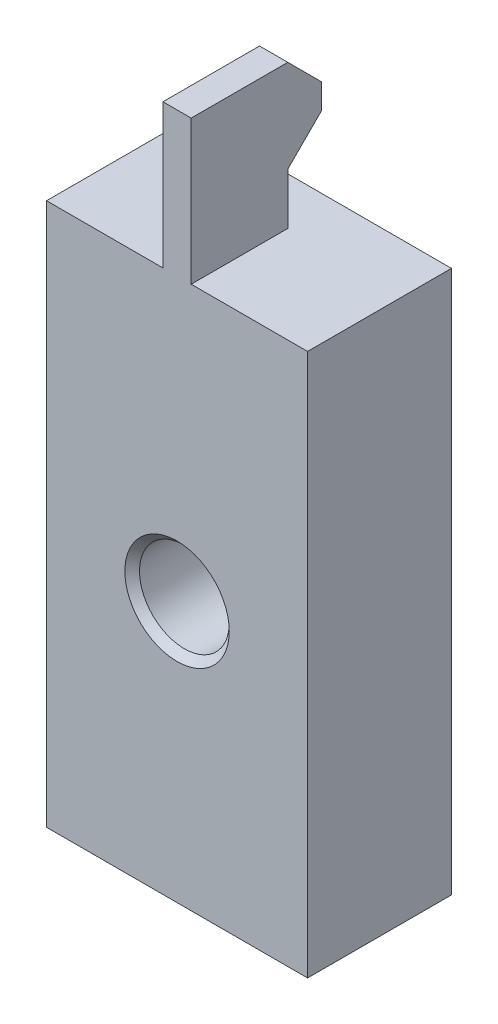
ISO-10303-21;
HEADER;
FILE_DESCRIPTION(('STEP AP214'),'2;1');
FILE_NAME('part.step','',(''),(''),'','','');
FILE_SCHEMA(('AUTOMOTIVE_DESIGN { 1 0 10303 214 1 1 1 1 }'));
ENDSEC;
DATA;
#1=APPLICATION_CONTEXT('core data for automotive mechanical design processes');
#2=APPLICATION_PROTOCOL_DEFINITION('international standard','automotive_design',2000,#1);
#3=PRODUCT_CONTEXT('',#1,'mechanical');
#4=PRODUCT('Part','Part','',(#3));
#5=PRODUCT_RELATED_PRODUCT_CATEGORY('part','',(#4));
#6=PRODUCT_DEFINITION_FORMATION('','',#4);
#7=PRODUCT_DEFINITION_CONTEXT('part definition',#1,'design');
#8=PRODUCT_DEFINITION('design','',#6,#7);
#9=PRODUCT_DEFINITION_SHAPE('','',#8);
#10=(LENGTH_UNIT() NAMED_UNIT(*) SI_UNIT(.MILLI.,.METRE.));
#11=(NAMED_UNIT(*) PLANE_ANGLE_UNIT() SI_UNIT($,.RADIAN.));
#12=(NAMED_UNIT(*) SI_UNIT($,.STERADIAN.) SOLID_ANGLE_UNIT());
#13=UNCERTAINTY_MEASURE_WITH_UNIT(LENGTH_MEASURE(1.E-05),#10,'distance_accuracy_value','');
#14=(GEOMETRIC_REPRESENTATION_CONTEXT(3) GLOBAL_UNCERTAINTY_ASSIGNED_CONTEXT((#13)) GLOBAL_UNIT_ASSIGNED_CONTEXT((#10,
#11,#12)) REPRESENTATION_CONTEXT('',''));
#15=CARTESIAN_POINT('',(0.,0.,0.));
#16=DIRECTION('',(0.,0.,1.));
#17=DIRECTION('',(1.,0.,0.));
#18=AXIS2_PLACEMENT_3D('',#15,#16,#17);
#19=CARTESIAN_POINT('',(-6.35,26.4,7.));
#20=DIRECTION('',(0.,-1.,0.));
#21=DIRECTION('',(0.,0.,-1.));
#22=AXIS2_PLACEMENT_3D('',#19,#20,#21);
#23=PLANE('',#22);
#24=DIRECTION('',(-1.,0.,0.));
#25=VECTOR('',#24,1.);
#26=CARTESIAN_POINT('',(-6.35,26.4,0.));
#27=LINE('',#26,#25);
#28=CARTESIAN_POINT('',(6.35,26.4,0.));
#29=VERTEX_POINT('',#28);
#30=CARTESIAN_POINT('',(-6.35,26.4,0.));
#31=VERTEX_POINT('',#30);
#32=EDGE_CURVE('E74',#29,#31,#27,.T.);
#33=ORIENTED_EDGE('',*,*,#32,.T.);
#34=DIRECTION('',(0.,0.,-1.));
#35=VECTOR('',#34,1.);
#36=CARTESIAN_POINT('',(-6.35,26.4,7.));
#37=LINE('',#36,#35);
#38=CARTESIAN_POINT('',(-6.35,26.4,7.));
#39=VERTEX_POINT('',#38);
#40=EDGE_CURVE('E78',#39,#31,#37,.T.);
#41=ORIENTED_EDGE('',*,*,#40,.F.);
#42=DIRECTION('',(-1.,0.,0.));
#43=VECTOR('',#42,1.);
#44=CARTESIAN_POINT('',(-6.35,26.4,7.));
#45=LINE('',#44,#43);
#46=CARTESIAN_POINT('',(-0.687500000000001,26.4,7.));
#47=VERTEX_POINT('',#46);
#48=EDGE_CURVE('E183',#47,#39,#45,.T.);
#49=ORIENTED_EDGE('',*,*,#48,.F.);
#50=DIRECTION('',(0.,0.,-1.));
#51=VECTOR('',#50,1.);
#52=CARTESIAN_POINT('',(-0.687500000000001,26.4,7.));
#53=LINE('',#52,#51);
#54=CARTESIAN_POINT('',(-0.687500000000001,26.4,2.3));
#55=VERTEX_POINT('',#54);
#56=EDGE_CURVE('E173',#47,#55,#53,.T.);
#57=ORIENTED_EDGE('',*,*,#56,.T.);
#58=DIRECTION('',(-1.,0.,0.));
#59=VECTOR('',#58,1.);
#60=CARTESIAN_POINT('',(6.35105,26.4,2.3));
#61=LINE('',#60,#59);
#62=CARTESIAN_POINT('',(0.687500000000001,26.4,2.3));
#63=VERTEX_POINT('',#62);
#64=EDGE_CURVE('E198',#63,#55,#61,.T.);
#65=ORIENTED_EDGE('',*,*,#64,.F.);
#66=DIRECTION('',(0.,0.,-1.));
#67=VECTOR('',#66,1.);
#68=CARTESIAN_POINT('',(0.687500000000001,26.4,7.));
#69=LINE('',#68,#67);
#70=CARTESIAN_POINT('',(0.687500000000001,26.4,7.));
#71=VERTEX_POINT('',#70);
#72=EDGE_CURVE('E151',#71,#63,#69,.T.);
#73=ORIENTED_EDGE('',*,*,#72,.F.);
#74=DIRECTION('',(-1.,0.,0.));
#75=VECTOR('',#74,1.);
#76=CARTESIAN_POINT('',(6.35,26.4,7.));
#77=LINE('',#76,#75);
#78=CARTESIAN_POINT('',(6.35,26.4,7.));
#79=VERTEX_POINT('',#78);
#80=EDGE_CURVE('E185',#79,#71,#77,.T.);
#81=ORIENTED_EDGE('',*,*,#80,.F.);
#82=DIRECTION('',(0.,0.,-1.));
#83=VECTOR('',#82,1.);
#84=CARTESIAN_POINT('',(6.35,26.4,7.));
#85=LINE('',#84,#83);
#86=EDGE_CURVE('E82',#79,#29,#85,.T.);
#87=ORIENTED_EDGE('',*,*,#86,.T.);
#88=EDGE_LOOP('',(#33,#41,#49,#57,#65,#73,#81,#87));
#89=FACE_BOUND('',#88,.T.);
#90=ADVANCED_FACE('F31',(#89),#23,.F.);
#91=CARTESIAN_POINT('',(-6.35,26.4,7.));
#92=DIRECTION('',(1.,0.,0.));
#93=DIRECTION('',(0.,1.,0.));
#94=AXIS2_PLACEMENT_3D('',#91,#92,#93);
#95=PLANE('',#94);
#96=DIRECTION('',(0.,-1.,0.));
#97=VECTOR('',#96,1.);
#98=CARTESIAN_POINT('',(-6.35,26.4,7.));
#99=LINE('',#98,#97);
#100=CARTESIAN_POINT('',(-6.35,0.,7.));
#101=VERTEX_POINT('',#100);
#102=EDGE_CURVE('E87',#39,#101,#99,.T.);
#103=ORIENTED_EDGE('',*,*,#102,.F.);
#104=ORIENTED_EDGE('',*,*,#40,.T.);
#105=DIRECTION('',(0.,-1.,0.));
#106=VECTOR('',#105,1.);
#107=CARTESIAN_POINT('',(-6.35,26.4,0.));
#108=LINE('',#107,#106);
#109=CARTESIAN_POINT('',(-6.35,0.,0.));
#110=VERTEX_POINT('',#109);
#111=EDGE_CURVE('E95',#31,#110,#108,.T.);
#112=ORIENTED_EDGE('',*,*,#111,.T.);
#113=DIRECTION('',(0.,0.,-1.));
#114=VECTOR('',#113,1.);
#115=CARTESIAN_POINT('',(-6.35,0.,7.));
#116=LINE('',#115,#114);
#117=EDGE_CURVE('E117',#101,#110,#116,.T.);
#118=ORIENTED_EDGE('',*,*,#117,.F.);
#119=EDGE_LOOP('',(#103,#104,#112,#118));
#120=FACE_BOUND('',#119,.T.);
#121=ADVANCED_FACE('F93',(#120),#95,.F.);
#122=CARTESIAN_POINT('',(-6.35,0.,7.));
#123=DIRECTION('',(0.,1.,0.));
#124=DIRECTION('',(0.,0.,1.));
#125=AXIS2_PLACEMENT_3D('',#122,#123,#124);
#126=PLANE('',#125);
#127=DIRECTION('',(1.,0.,0.));
#128=VECTOR('',#127,1.);
#129=CARTESIAN_POINT('',(-6.35,0.,0.));
#130=LINE('',#129,#128);
#131=CARTESIAN_POINT('',(6.35,0.,0.));
#132=VERTEX_POINT('',#131);
#133=EDGE_CURVE('E99',#110,#132,#130,.T.);
#134=ORIENTED_EDGE('',*,*,#133,.T.);
#135=DIRECTION('',(0.,0.,-1.));
#136=VECTOR('',#135,1.);
#137=CARTESIAN_POINT('',(6.35,0.,7.));
#138=LINE('',#137,#136);
#139=CARTESIAN_POINT('',(6.35,0.,7.));
#140=VERTEX_POINT('',#139);
#141=EDGE_CURVE('E119',#140,#132,#138,.T.);
#142=ORIENTED_EDGE('',*,*,#141,.F.);
#143=DIRECTION('',(1.,0.,0.));
#144=VECTOR('',#143,1.);
#145=CARTESIAN_POINT('',(-6.35,0.,7.));
#146=LINE('',#145,#144);
#147=EDGE_CURVE('E55',#101,#140,#146,.T.);
#148=ORIENTED_EDGE('',*,*,#147,.F.);
#149=ORIENTED_EDGE('',*,*,#117,.T.);
#150=EDGE_LOOP('',(#134,#142,#148,#149));
#151=FACE_BOUND('',#150,.T.);
#152=ADVANCED_FACE('F245',(#151),#126,.F.);
#153=CARTESIAN_POINT('',(6.35,26.4,7.));
#154=DIRECTION('',(-1.,0.,0.));
#155=DIRECTION('',(0.,-1.,0.));
#156=AXIS2_PLACEMENT_3D('',#153,#154,#155);
#157=PLANE('',#156);
#158=ORIENTED_EDGE('',*,*,#86,.F.);
#159=DIRECTION('',(0.,1.,0.));
#160=VECTOR('',#159,1.);
#161=CARTESIAN_POINT('',(6.35,26.4,7.));
#162=LINE('',#161,#160);
#163=EDGE_CURVE('E96',#140,#79,#162,.T.);
#164=ORIENTED_EDGE('',*,*,#163,.F.);
#165=ORIENTED_EDGE('',*,*,#141,.T.);
#166=DIRECTION('',(0.,1.,0.));
#167=VECTOR('',#166,1.);
#168=CARTESIAN_POINT('',(6.35,26.4,0.));
#169=LINE('',#168,#167);
#170=EDGE_CURVE('E88',#132,#29,#169,.T.);
#171=ORIENTED_EDGE('',*,*,#170,.T.);
#172=EDGE_LOOP('',(#158,#164,#165,#171));
#173=FACE_BOUND('',#172,.T.);
#174=ADVANCED_FACE('F220',(#173),#157,.F.);
#175=CARTESIAN_POINT('',(-6.35,0.,7.));
#176=DIRECTION('',(0.,0.,1.));
#177=DIRECTION('',(1.,0.,0.));
#178=AXIS2_PLACEMENT_3D('',#175,#176,#177);
#179=PLANE('',#178);
#180=DIRECTION('',(0.,-1.,0.));
#181=VECTOR('',#180,1.);
#182=CARTESIAN_POINT('',(-0.687500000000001,26.4,7.));
#183=LINE('',#182,#181);
#184=CARTESIAN_POINT('',(-0.687500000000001,33.4,7.));
#185=VERTEX_POINT('',#184);
#186=EDGE_CURVE('E239',#185,#47,#183,.T.);
#187=ORIENTED_EDGE('',*,*,#186,.T.);
#188=ORIENTED_EDGE('',*,*,#48,.T.);
#189=ORIENTED_EDGE('',*,*,#102,.T.);
#190=ORIENTED_EDGE('',*,*,#147,.T.);
#191=ORIENTED_EDGE('',*,*,#163,.T.);
#192=ORIENTED_EDGE('',*,*,#80,.T.);
#193=DIRECTION('',(0.,1.,0.));
#194=VECTOR('',#193,1.);
#195=CARTESIAN_POINT('',(0.687500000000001,26.4,7.));
#196=LINE('',#195,#194);
#197=CARTESIAN_POINT('',(0.687500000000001,33.4,7.));
#198=VERTEX_POINT('',#197);
#199=EDGE_CURVE('E188',#71,#198,#196,.T.);
#200=ORIENTED_EDGE('',*,*,#199,.T.);
#201=DIRECTION('',(-1.,0.,0.));
#202=VECTOR('',#201,1.);
#203=CARTESIAN_POINT('',(15.8010581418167,33.4,7.));
#204=LINE('',#203,#202);
#205=EDGE_CURVE('E150',#198,#185,#204,.T.);
#206=ORIENTED_EDGE('',*,*,#205,.T.);
#207=EDGE_LOOP('',(#187,#188,#189,#190,#191,#192,#200,#206));
#208=FACE_BOUND('',#207,.T.);
#209=CARTESIAN_POINT('',(0.,12.7,7.));
#210=DIRECTION('',(0.,0.,1.));
#211=DIRECTION('',(1.,0.,0.));
#212=AXIS2_PLACEMENT_3D('',#209,#210,#211);
#213=CIRCLE('',#212,2.54);
#214=CARTESIAN_POINT('',(2.54,12.7,7.));
#215=VERTEX_POINT('',#214);
#216=EDGE_CURVE('E205',#215,#215,#213,.T.);
#217=ORIENTED_EDGE('',*,*,#216,.F.);
#218=EDGE_LOOP('',(#217));
#219=FACE_BOUND('',#218,.T.);
#220=ADVANCED_FACE('F213',(#208,#219),#179,.T.);
#221=CARTESIAN_POINT('',(-6.35,0.,0.));
#222=DIRECTION('',(0.,0.,1.));
#223=DIRECTION('',(1.,0.,0.));
#224=AXIS2_PLACEMENT_3D('',#221,#222,#223);
#225=PLANE('',#224);
#226=CARTESIAN_POINT('',(0.,12.7,0.));
#227=DIRECTION('',(0.,0.,1.));
#228=DIRECTION('',(1.,0.,0.));
#229=AXIS2_PLACEMENT_3D('',#226,#227,#228);
#230=CIRCLE('',#229,2.18287599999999);
#231=CARTESIAN_POINT('',(2.18287599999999,12.7,0.));
#232=VERTEX_POINT('',#231);
#233=EDGE_CURVE('E101',#232,#232,#230,.T.);
#234=ORIENTED_EDGE('',*,*,#233,.T.);
#235=EDGE_LOOP('',(#234));
#236=FACE_BOUND('',#235,.T.);
#237=ORIENTED_EDGE('',*,*,#111,.F.);
#238=ORIENTED_EDGE('',*,*,#32,.F.);
#239=ORIENTED_EDGE('',*,*,#170,.F.);
#240=ORIENTED_EDGE('',*,*,#133,.F.);
#241=EDGE_LOOP('',(#237,#238,#239,#240));
#242=FACE_BOUND('',#241,.T.);
#243=ADVANCED_FACE('F98',(#236,#242),#225,.F.);
#244=CARTESIAN_POINT('',(0.,12.7,7.));
#245=DIRECTION('',(0.,0.,1.));
#246=DIRECTION('',(1.,0.,0.));
#247=AXIS2_PLACEMENT_3D('',#244,#245,#246);
#248=CYLINDRICAL_SURFACE('',#247,2.18287599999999);
#249=ORIENTED_EDGE('',*,*,#233,.F.);
#250=EDGE_LOOP('',(#249));
#251=FACE_BOUND('',#250,.T.);
#252=CARTESIAN_POINT('',(0.,12.7,6.642876));
#253=DIRECTION('',(0.,0.,1.));
#254=DIRECTION('',(1.,0.,0.));
#255=AXIS2_PLACEMENT_3D('',#252,#253,#254);
#256=CIRCLE('',#255,2.182876);
#257=CARTESIAN_POINT('',(2.182876,12.7,6.642876));
#258=VERTEX_POINT('',#257);
#259=EDGE_CURVE('E105',#258,#258,#256,.T.);
#260=ORIENTED_EDGE('',*,*,#259,.T.);
#261=EDGE_LOOP('',(#260));
#262=FACE_BOUND('',#261,.T.);
#263=ADVANCED_FACE('F261',(#251,#262),#248,.F.);
#264=CARTESIAN_POINT('',(0.,12.7,7.));
#265=DIRECTION('',(0.,0.,1.));
#266=DIRECTION('',(1.,0.,0.));
#267=AXIS2_PLACEMENT_3D('',#264,#265,#266);
#268=CONICAL_SURFACE('',#267,2.54,0.785398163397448);
#269=ORIENTED_EDGE('',*,*,#259,.F.);
#270=EDGE_LOOP('',(#269));
#271=FACE_BOUND('',#270,.T.);
#272=ORIENTED_EDGE('',*,*,#216,.T.);
#273=EDGE_LOOP('',(#272));
#274=FACE_BOUND('',#273,.T.);
#275=ADVANCED_FACE('F267',(#271,#274),#268,.F.);
#276=CARTESIAN_POINT('',(15.8010581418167,26.4,0.65));
#277=DIRECTION('',(0.,0.,-1.));
#278=DIRECTION('',(-1.,0.,0.));
#279=AXIS2_PLACEMENT_3D('',#276,#277,#278);
#280=PLANE('',#279);
#281=DIRECTION('',(0.,-1.,0.));
#282=VECTOR('',#281,1.);
#283=CARTESIAN_POINT('',(-0.687500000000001,26.4,0.65));
#284=LINE('',#283,#282);
#285=CARTESIAN_POINT('',(-0.687500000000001,31.75,0.65));
#286=VERTEX_POINT('',#285);
#287=CARTESIAN_POINT('',(-0.687500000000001,30.55,0.65));
#288=VERTEX_POINT('',#287);
#289=EDGE_CURVE('E165',#286,#288,#284,.T.);
#290=ORIENTED_EDGE('',*,*,#289,.F.);
#291=DIRECTION('',(1.,0.,0.));
#292=VECTOR('',#291,1.);
#293=CARTESIAN_POINT('',(15.8010581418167,31.75,0.65));
#294=LINE('',#293,#292);
#295=CARTESIAN_POINT('',(0.687500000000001,31.75,0.65));
#296=VERTEX_POINT('',#295);
#297=EDGE_CURVE('E46',#286,#296,#294,.T.);
#298=ORIENTED_EDGE('',*,*,#297,.T.);
#299=DIRECTION('',(0.,1.,0.));
#300=VECTOR('',#299,1.);
#301=CARTESIAN_POINT('',(0.687500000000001,26.4,0.65));
#302=LINE('',#301,#300);
#303=CARTESIAN_POINT('',(0.687500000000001,30.55,0.65));
#304=VERTEX_POINT('',#303);
#305=EDGE_CURVE('E138',#304,#296,#302,.T.);
#306=ORIENTED_EDGE('',*,*,#305,.F.);
#307=DIRECTION('',(-1.,0.,0.));
#308=VECTOR('',#307,1.);
#309=CARTESIAN_POINT('',(-6.35,30.55,0.65));
#310=LINE('',#309,#308);
#311=EDGE_CURVE('E121',#304,#288,#310,.T.);
#312=ORIENTED_EDGE('',*,*,#311,.T.);
#313=EDGE_LOOP('',(#290,#298,#306,#312));
#314=FACE_BOUND('',#313,.T.);
#315=ADVANCED_FACE('F170',(#314),#280,.T.);
#316=CARTESIAN_POINT('',(15.8010581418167,33.4,7.));
#317=DIRECTION('',(0.,1.,0.));
#318=DIRECTION('',(-1.,0.,0.));
#319=AXIS2_PLACEMENT_3D('',#316,#317,#318);
#320=PLANE('',#319);
#321=DIRECTION('',(0.,0.,-1.));
#322=VECTOR('',#321,1.);
#323=CARTESIAN_POINT('',(-0.687500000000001,33.4,7.));
#324=LINE('',#323,#322);
#325=CARTESIAN_POINT('',(-0.687500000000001,33.4,2.3));
#326=VERTEX_POINT('',#325);
#327=EDGE_CURVE('E168',#185,#326,#324,.T.);
#328=ORIENTED_EDGE('',*,*,#327,.F.);
#329=ORIENTED_EDGE('',*,*,#205,.F.);
#330=DIRECTION('',(0.,0.,-1.));
#331=VECTOR('',#330,1.);
#332=CARTESIAN_POINT('',(0.687500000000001,33.4,7.));
#333=LINE('',#332,#331);
#334=CARTESIAN_POINT('',(0.687500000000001,33.4,2.29999999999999));
#335=VERTEX_POINT('',#334);
#336=EDGE_CURVE('E136',#198,#335,#333,.T.);
#337=ORIENTED_EDGE('',*,*,#336,.T.);
#338=DIRECTION('',(-1.,0.,0.));
#339=VECTOR('',#338,1.);
#340=CARTESIAN_POINT('',(15.8010581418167,33.4,2.29999999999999));
#341=LINE('',#340,#339);
#342=EDGE_CURVE('E124',#335,#326,#341,.T.);
#343=ORIENTED_EDGE('',*,*,#342,.T.);
#344=EDGE_LOOP('',(#328,#329,#337,#343));
#345=FACE_BOUND('',#344,.T.);
#346=ADVANCED_FACE('F147',(#345),#320,.T.);
#347=CARTESIAN_POINT('',(6.35105,26.4,2.3));
#348=DIRECTION('',(0.,0.,1.));
#349=DIRECTION('',(1.,0.,0.));
#350=AXIS2_PLACEMENT_3D('',#347,#348,#349);
#351=PLANE('',#350);
#352=ORIENTED_EDGE('',*,*,#64,.T.);
#353=DIRECTION('',(0.,1.,0.));
#354=VECTOR('',#353,1.);
#355=CARTESIAN_POINT('',(-0.687500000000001,26.4,2.3));
#356=LINE('',#355,#354);
#357=CARTESIAN_POINT('',(-0.687500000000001,28.9,2.3));
#358=VERTEX_POINT('',#357);
#359=EDGE_CURVE('E175',#55,#358,#356,.T.);
#360=ORIENTED_EDGE('',*,*,#359,.T.);
#361=DIRECTION('',(-1.,0.,0.));
#362=VECTOR('',#361,1.);
#363=CARTESIAN_POINT('',(6.35105,28.9,2.3));
#364=LINE('',#363,#362);
#365=CARTESIAN_POINT('',(0.687499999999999,28.9,2.3));
#366=VERTEX_POINT('',#365);
#367=EDGE_CURVE('E199',#366,#358,#364,.T.);
#368=ORIENTED_EDGE('',*,*,#367,.F.);
#369=DIRECTION('',(0.,-1.,0.));
#370=VECTOR('',#369,1.);
#371=CARTESIAN_POINT('',(0.687500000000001,26.4,2.3));
#372=LINE('',#371,#370);
#373=EDGE_CURVE('E195',#366,#63,#372,.T.);
#374=ORIENTED_EDGE('',*,*,#373,.T.);
#375=EDGE_LOOP('',(#352,#360,#368,#374));
#376=FACE_BOUND('',#375,.T.);
#377=ADVANCED_FACE('F234',(#376),#351,.F.);
#378=CARTESIAN_POINT('',(15.8010581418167,30.55,0.65));
#379=DIRECTION('',(0.,-0.707106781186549,-0.707106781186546));
#380=DIRECTION('',(0.,0.707106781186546,-0.707106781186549));
#381=AXIS2_PLACEMENT_3D('',#378,#379,#380);
#382=PLANE('',#381);
#383=DIRECTION('',(0.,-0.707106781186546,0.707106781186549));
#384=VECTOR('',#383,1.);
#385=CARTESIAN_POINT('',(-0.687500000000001,30.55,0.649999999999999));
#386=LINE('',#385,#384);
#387=EDGE_CURVE('E172',#288,#358,#386,.T.);
#388=ORIENTED_EDGE('',*,*,#387,.F.);
#389=ORIENTED_EDGE('',*,*,#311,.F.);
#390=DIRECTION('',(0.,0.707106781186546,-0.707106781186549));
#391=VECTOR('',#390,1.);
#392=CARTESIAN_POINT('',(0.687499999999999,30.55,0.649999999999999));
#393=LINE('',#392,#391);
#394=EDGE_CURVE('E193',#366,#304,#393,.T.);
#395=ORIENTED_EDGE('',*,*,#394,.F.);
#396=ORIENTED_EDGE('',*,*,#367,.T.);
#397=EDGE_LOOP('',(#388,#389,#395,#396));
#398=FACE_BOUND('',#397,.T.);
#399=ADVANCED_FACE('F232',(#398),#382,.T.);
#400=CARTESIAN_POINT('',(15.8010581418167,33.4,2.29999999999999));
#401=DIRECTION('',(0.,-0.707106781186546,0.707106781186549));
#402=DIRECTION('',(0.,-0.707106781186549,-0.707106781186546));
#403=AXIS2_PLACEMENT_3D('',#400,#401,#402);
#404=PLANE('',#403);
#405=DIRECTION('',(0.,0.707106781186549,0.707106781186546));
#406=VECTOR('',#405,1.);
#407=CARTESIAN_POINT('',(-0.687500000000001,33.4,2.29999999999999));
#408=LINE('',#407,#406);
#409=EDGE_CURVE('E11',#326,#286,#408,.F.);
#410=ORIENTED_EDGE('',*,*,#409,.F.);
#411=ORIENTED_EDGE('',*,*,#342,.F.);
#412=DIRECTION('',(0.,-0.707106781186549,-0.707106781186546));
#413=VECTOR('',#412,1.);
#414=CARTESIAN_POINT('',(0.687500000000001,33.4,2.29999999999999));
#415=LINE('',#414,#413);
#416=EDGE_CURVE('E39',#296,#335,#415,.F.);
#417=ORIENTED_EDGE('',*,*,#416,.F.);
#418=ORIENTED_EDGE('',*,*,#297,.F.);
#419=EDGE_LOOP('',(#410,#411,#417,#418));
#420=FACE_BOUND('',#419,.T.);
#421=ADVANCED_FACE('F33',(#420),#404,.F.);
#422=CARTESIAN_POINT('',(0.687500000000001,26.4,7.));
#423=DIRECTION('',(-1.,0.,0.));
#424=DIRECTION('',(0.,0.,1.));
#425=AXIS2_PLACEMENT_3D('',#422,#423,#424);
#426=PLANE('',#425);
#427=ORIENTED_EDGE('',*,*,#394,.T.);
#428=ORIENTED_EDGE('',*,*,#305,.T.);
#429=ORIENTED_EDGE('',*,*,#416,.T.);
#430=ORIENTED_EDGE('',*,*,#336,.F.);
#431=ORIENTED_EDGE('',*,*,#199,.F.);
#432=ORIENTED_EDGE('',*,*,#72,.T.);
#433=ORIENTED_EDGE('',*,*,#373,.F.);
#434=EDGE_LOOP('',(#427,#428,#429,#430,#431,#432,#433));
#435=FACE_BOUND('',#434,.T.);
#436=ADVANCED_FACE('F133',(#435),#426,.F.);
#437=CARTESIAN_POINT('',(-0.687500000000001,26.4,7.));
#438=DIRECTION('',(1.,0.,0.));
#439=DIRECTION('',(0.,0.,-1.));
#440=AXIS2_PLACEMENT_3D('',#437,#438,#439);
#441=PLANE('',#440);
#442=ORIENTED_EDGE('',*,*,#56,.F.);
#443=ORIENTED_EDGE('',*,*,#186,.F.);
#444=ORIENTED_EDGE('',*,*,#327,.T.);
#445=ORIENTED_EDGE('',*,*,#409,.T.);
#446=ORIENTED_EDGE('',*,*,#289,.T.);
#447=ORIENTED_EDGE('',*,*,#387,.T.);
#448=ORIENTED_EDGE('',*,*,#359,.F.);
#449=EDGE_LOOP('',(#442,#443,#444,#445,#446,#447,#448));
#450=FACE_BOUND('',#449,.T.);
#451=ADVANCED_FACE('F162',(#450),#441,.F.);
#452=CLOSED_SHELL('',(#90,#121,#152,#174,#220,#243,#263,#275,#315,#346,#377,#399,#421,#436,#451));
#453=MANIFOLD_SOLID_BREP('B2',#452);
#454=ADVANCED_BREP_SHAPE_REPRESENTATION('',(#18,#453),#14);
#455=SHAPE_DEFINITION_REPRESENTATION(#9,#454);
ENDSEC;
END-ISO-10303-21;
